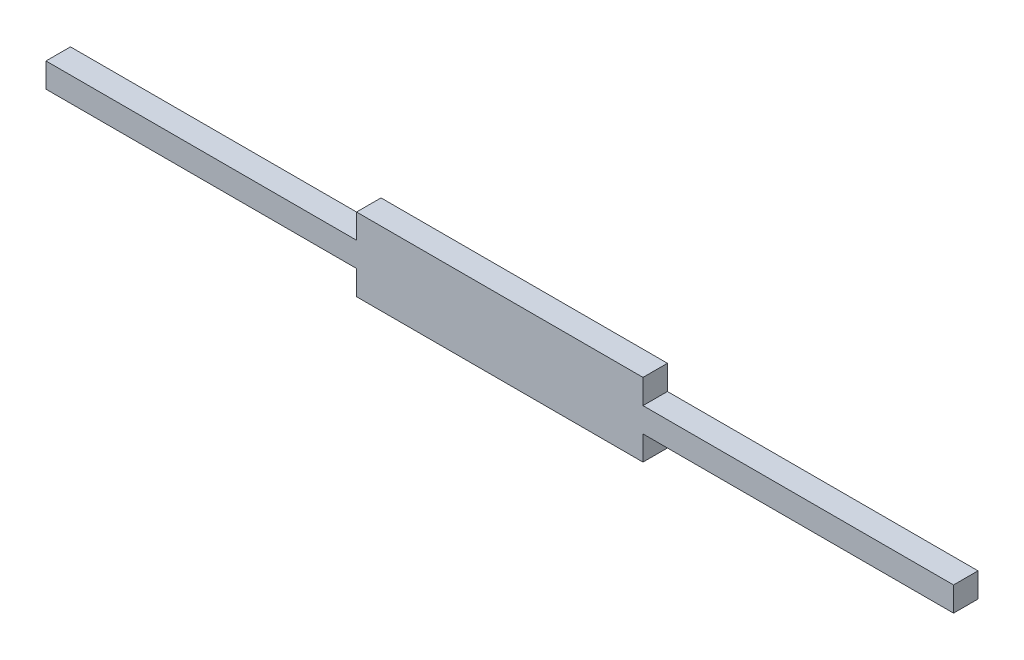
ISO-10303-21;
HEADER;
FILE_DESCRIPTION(('STEP AP214'),'2;1');
FILE_NAME('part.step','',(''),(''),'','','');
FILE_SCHEMA(('AUTOMOTIVE_DESIGN { 1 0 10303 214 1 1 1 1 }'));
ENDSEC;
DATA;
#1=APPLICATION_CONTEXT('core data for automotive mechanical design processes');
#2=APPLICATION_PROTOCOL_DEFINITION('international standard','automotive_design',2000,#1);
#3=PRODUCT_CONTEXT('',#1,'mechanical');
#4=PRODUCT('Part','Part','',(#3));
#5=PRODUCT_RELATED_PRODUCT_CATEGORY('part','',(#4));
#6=PRODUCT_DEFINITION_FORMATION('','',#4);
#7=PRODUCT_DEFINITION_CONTEXT('part definition',#1,'design');
#8=PRODUCT_DEFINITION('design','',#6,#7);
#9=PRODUCT_DEFINITION_SHAPE('','',#8);
#10=(LENGTH_UNIT() NAMED_UNIT(*) SI_UNIT(.MILLI.,.METRE.));
#11=(NAMED_UNIT(*) PLANE_ANGLE_UNIT() SI_UNIT($,.RADIAN.));
#12=(NAMED_UNIT(*) SI_UNIT($,.STERADIAN.) SOLID_ANGLE_UNIT());
#13=UNCERTAINTY_MEASURE_WITH_UNIT(LENGTH_MEASURE(1.E-05),#10,'distance_accuracy_value','');
#14=(GEOMETRIC_REPRESENTATION_CONTEXT(3) GLOBAL_UNCERTAINTY_ASSIGNED_CONTEXT((#13)) GLOBAL_UNIT_ASSIGNED_CONTEXT((#10,
#11,#12)) REPRESENTATION_CONTEXT('',''));
#15=CARTESIAN_POINT('',(0.,0.,0.));
#16=DIRECTION('',(0.,0.,1.));
#17=DIRECTION('',(1.,0.,0.));
#18=AXIS2_PLACEMENT_3D('',#15,#16,#17);
#19=CARTESIAN_POINT('',(-38.0590279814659,-1.524,1.524));
#20=DIRECTION('',(0.,-1.,0.));
#21=DIRECTION('',(0.,0.,-1.));
#22=AXIS2_PLACEMENT_3D('',#19,#20,#21);
#23=PLANE('',#22);
#24=DIRECTION('',(-1.,0.,0.));
#25=VECTOR('',#24,1.);
#26=CARTESIAN_POINT('',(-38.0590279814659,-1.524,0.));
#27=LINE('',#26,#25);
#28=CARTESIAN_POINT('',(-38.0590279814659,-1.524,0.));
#29=VERTEX_POINT('',#28);
#30=CARTESIAN_POINT('',(-57.4057448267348,-1.524,0.));
#31=VERTEX_POINT('',#30);
#32=EDGE_CURVE('E154',#29,#31,#27,.T.);
#33=ORIENTED_EDGE('',*,*,#32,.T.);
#34=DIRECTION('',(0.,0.,-1.));
#35=VECTOR('',#34,1.);
#36=CARTESIAN_POINT('',(-57.4057448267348,-1.524,1.524));
#37=LINE('',#36,#35);
#38=CARTESIAN_POINT('',(-57.4057448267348,-1.524,1.524));
#39=VERTEX_POINT('',#38);
#40=EDGE_CURVE('E11',#39,#31,#37,.T.);
#41=ORIENTED_EDGE('',*,*,#40,.F.);
#42=DIRECTION('',(-1.,0.,0.));
#43=VECTOR('',#42,1.);
#44=CARTESIAN_POINT('',(-38.0590279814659,-1.524,1.524));
#45=LINE('',#44,#43);
#46=CARTESIAN_POINT('',(-38.0590279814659,-1.524,1.524));
#47=VERTEX_POINT('',#46);
#48=EDGE_CURVE('E176',#47,#39,#45,.T.);
#49=ORIENTED_EDGE('',*,*,#48,.F.);
#50=DIRECTION('',(0.,0.,-1.));
#51=VECTOR('',#50,1.);
#52=CARTESIAN_POINT('',(-38.0590279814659,-1.524,1.524));
#53=LINE('',#52,#51);
#54=EDGE_CURVE('E150',#47,#29,#53,.T.);
#55=ORIENTED_EDGE('',*,*,#54,.T.);
#56=EDGE_LOOP('',(#33,#41,#49,#55));
#57=FACE_BOUND('',#56,.T.);
#58=ADVANCED_FACE('F34',(#57),#23,.F.);
#59=CARTESIAN_POINT('',(-57.4057448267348,-1.524,1.524));
#60=DIRECTION('',(1.,0.,0.));
#61=DIRECTION('',(0.,0.,-1.));
#62=AXIS2_PLACEMENT_3D('',#59,#60,#61);
#63=PLANE('',#62);
#64=DIRECTION('',(0.,-1.,0.));
#65=VECTOR('',#64,1.);
#66=CARTESIAN_POINT('',(-57.4057448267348,-1.524,0.));
#67=LINE('',#66,#65);
#68=CARTESIAN_POINT('',(-57.4057448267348,-3.048,0.));
#69=VERTEX_POINT('',#68);
#70=EDGE_CURVE('E157',#31,#69,#67,.T.);
#71=ORIENTED_EDGE('',*,*,#70,.T.);
#72=DIRECTION('',(0.,0.,-1.));
#73=VECTOR('',#72,1.);
#74=CARTESIAN_POINT('',(-57.4057448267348,-3.048,1.524));
#75=LINE('',#74,#73);
#76=CARTESIAN_POINT('',(-57.4057448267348,-3.048,1.524));
#77=VERTEX_POINT('',#76);
#78=EDGE_CURVE('E42',#77,#69,#75,.T.);
#79=ORIENTED_EDGE('',*,*,#78,.F.);
#80=DIRECTION('',(0.,-1.,0.));
#81=VECTOR('',#80,1.);
#82=CARTESIAN_POINT('',(-57.4057448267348,-1.524,1.524));
#83=LINE('',#82,#81);
#84=EDGE_CURVE('E105',#39,#77,#83,.T.);
#85=ORIENTED_EDGE('',*,*,#84,.F.);
#86=ORIENTED_EDGE('',*,*,#40,.T.);
#87=EDGE_LOOP('',(#71,#79,#85,#86));
#88=FACE_BOUND('',#87,.T.);
#89=ADVANCED_FACE('F254',(#88),#63,.F.);
#90=CARTESIAN_POINT('',(-38.0590279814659,-3.048,1.524));
#91=DIRECTION('',(0.,1.,0.));
#92=DIRECTION('',(0.,0.,1.));
#93=AXIS2_PLACEMENT_3D('',#90,#91,#92);
#94=PLANE('',#93);
#95=DIRECTION('',(1.,0.,0.));
#96=VECTOR('',#95,1.);
#97=CARTESIAN_POINT('',(-38.0590279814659,-3.048,0.));
#98=LINE('',#97,#96);
#99=CARTESIAN_POINT('',(-38.0590279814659,-3.048,0.));
#100=VERTEX_POINT('',#99);
#101=EDGE_CURVE('E159',#69,#100,#98,.T.);
#102=ORIENTED_EDGE('',*,*,#101,.T.);
#103=DIRECTION('',(0.,0.,-1.));
#104=VECTOR('',#103,1.);
#105=CARTESIAN_POINT('',(-38.0590279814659,-3.048,1.524));
#106=LINE('',#105,#104);
#107=CARTESIAN_POINT('',(-38.0590279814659,-3.048,1.524));
#108=VERTEX_POINT('',#107);
#109=EDGE_CURVE('E195',#108,#100,#106,.T.);
#110=ORIENTED_EDGE('',*,*,#109,.F.);
#111=DIRECTION('',(1.,0.,0.));
#112=VECTOR('',#111,1.);
#113=CARTESIAN_POINT('',(-38.0590279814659,-3.048,1.524));
#114=LINE('',#113,#112);
#115=EDGE_CURVE('E203',#77,#108,#114,.T.);
#116=ORIENTED_EDGE('',*,*,#115,.F.);
#117=ORIENTED_EDGE('',*,*,#78,.T.);
#118=EDGE_LOOP('',(#102,#110,#116,#117));
#119=FACE_BOUND('',#118,.T.);
#120=ADVANCED_FACE('F201',(#119),#94,.F.);
#121=CARTESIAN_POINT('',(-38.0590279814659,-3.048,1.524));
#122=DIRECTION('',(1.,0.,0.));
#123=DIRECTION('',(0.,0.,-1.));
#124=AXIS2_PLACEMENT_3D('',#121,#122,#123);
#125=PLANE('',#124);
#126=DIRECTION('',(0.,-1.,0.));
#127=VECTOR('',#126,1.);
#128=CARTESIAN_POINT('',(-38.0590279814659,-3.048,0.));
#129=LINE('',#128,#127);
#130=CARTESIAN_POINT('',(-38.0590279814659,-4.572,0.));
#131=VERTEX_POINT('',#130);
#132=EDGE_CURVE('E161',#100,#131,#129,.T.);
#133=ORIENTED_EDGE('',*,*,#132,.T.);
#134=DIRECTION('',(0.,0.,-1.));
#135=VECTOR('',#134,1.);
#136=CARTESIAN_POINT('',(-38.0590279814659,-4.572,1.524));
#137=LINE('',#136,#135);
#138=CARTESIAN_POINT('',(-38.0590279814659,-4.572,1.524));
#139=VERTEX_POINT('',#138);
#140=EDGE_CURVE('E192',#139,#131,#137,.T.);
#141=ORIENTED_EDGE('',*,*,#140,.F.);
#142=DIRECTION('',(0.,-1.,0.));
#143=VECTOR('',#142,1.);
#144=CARTESIAN_POINT('',(-38.0590279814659,-3.048,1.524));
#145=LINE('',#144,#143);
#146=EDGE_CURVE('E221',#108,#139,#145,.T.);
#147=ORIENTED_EDGE('',*,*,#146,.F.);
#148=ORIENTED_EDGE('',*,*,#109,.T.);
#149=EDGE_LOOP('',(#133,#141,#147,#148));
#150=FACE_BOUND('',#149,.T.);
#151=ADVANCED_FACE('F212',(#150),#125,.F.);
#152=CARTESIAN_POINT('',(-38.0590279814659,-4.572,1.524));
#153=DIRECTION('',(0.,1.,0.));
#154=DIRECTION('',(0.,0.,1.));
#155=AXIS2_PLACEMENT_3D('',#152,#153,#154);
#156=PLANE('',#155);
#157=DIRECTION('',(1.,0.,0.));
#158=VECTOR('',#157,1.);
#159=CARTESIAN_POINT('',(-38.0590279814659,-4.572,0.));
#160=LINE('',#159,#158);
#161=CARTESIAN_POINT('',(-20.2134687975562,-4.572,0.));
#162=VERTEX_POINT('',#161);
#163=EDGE_CURVE('E163',#131,#162,#160,.T.);
#164=ORIENTED_EDGE('',*,*,#163,.T.);
#165=DIRECTION('',(0.,0.,-1.));
#166=VECTOR('',#165,1.);
#167=CARTESIAN_POINT('',(-20.2134687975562,-4.572,1.524));
#168=LINE('',#167,#166);
#169=CARTESIAN_POINT('',(-20.2134687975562,-4.572,1.524));
#170=VERTEX_POINT('',#169);
#171=EDGE_CURVE('E189',#170,#162,#168,.T.);
#172=ORIENTED_EDGE('',*,*,#171,.F.);
#173=DIRECTION('',(1.,0.,0.));
#174=VECTOR('',#173,1.);
#175=CARTESIAN_POINT('',(-38.0590279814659,-4.572,1.524));
#176=LINE('',#175,#174);
#177=EDGE_CURVE('E218',#139,#170,#176,.T.);
#178=ORIENTED_EDGE('',*,*,#177,.F.);
#179=ORIENTED_EDGE('',*,*,#140,.T.);
#180=EDGE_LOOP('',(#164,#172,#178,#179));
#181=FACE_BOUND('',#180,.T.);
#182=ADVANCED_FACE('F216',(#181),#156,.F.);
#183=CARTESIAN_POINT('',(-20.2134687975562,-4.572,1.524));
#184=DIRECTION('',(-1.,0.,0.));
#185=DIRECTION('',(0.,0.,1.));
#186=AXIS2_PLACEMENT_3D('',#183,#184,#185);
#187=PLANE('',#186);
#188=DIRECTION('',(0.,1.,0.));
#189=VECTOR('',#188,1.);
#190=CARTESIAN_POINT('',(-20.2134687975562,-4.572,0.));
#191=LINE('',#190,#189);
#192=CARTESIAN_POINT('',(-20.2134687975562,-3.048,0.));
#193=VERTEX_POINT('',#192);
#194=EDGE_CURVE('E165',#162,#193,#191,.T.);
#195=ORIENTED_EDGE('',*,*,#194,.T.);
#196=DIRECTION('',(0.,0.,-1.));
#197=VECTOR('',#196,1.);
#198=CARTESIAN_POINT('',(-20.2134687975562,-3.048,1.524));
#199=LINE('',#198,#197);
#200=CARTESIAN_POINT('',(-20.2134687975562,-3.048,1.524));
#201=VERTEX_POINT('',#200);
#202=EDGE_CURVE('E186',#201,#193,#199,.T.);
#203=ORIENTED_EDGE('',*,*,#202,.F.);
#204=DIRECTION('',(0.,1.,0.));
#205=VECTOR('',#204,1.);
#206=CARTESIAN_POINT('',(-20.2134687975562,-4.572,1.524));
#207=LINE('',#206,#205);
#208=EDGE_CURVE('E220',#170,#201,#207,.T.);
#209=ORIENTED_EDGE('',*,*,#208,.F.);
#210=ORIENTED_EDGE('',*,*,#171,.T.);
#211=EDGE_LOOP('',(#195,#203,#209,#210));
#212=FACE_BOUND('',#211,.T.);
#213=ADVANCED_FACE('F267',(#212),#187,.F.);
#214=CARTESIAN_POINT('',(-20.2134687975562,-3.048,1.524));
#215=DIRECTION('',(0.,1.,0.));
#216=DIRECTION('',(0.,0.,1.));
#217=AXIS2_PLACEMENT_3D('',#214,#215,#216);
#218=PLANE('',#217);
#219=DIRECTION('',(1.,0.,0.));
#220=VECTOR('',#219,1.);
#221=CARTESIAN_POINT('',(-20.2134687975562,-3.048,0.));
#222=LINE('',#221,#220);
#223=CARTESIAN_POINT('',(-0.866751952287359,-3.048,0.));
#224=VERTEX_POINT('',#223);
#225=EDGE_CURVE('E167',#193,#224,#222,.T.);
#226=ORIENTED_EDGE('',*,*,#225,.T.);
#227=DIRECTION('',(0.,0.,-1.));
#228=VECTOR('',#227,1.);
#229=CARTESIAN_POINT('',(-0.866751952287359,-3.048,1.524));
#230=LINE('',#229,#228);
#231=CARTESIAN_POINT('',(-0.866751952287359,-3.048,1.524));
#232=VERTEX_POINT('',#231);
#233=EDGE_CURVE('E183',#232,#224,#230,.T.);
#234=ORIENTED_EDGE('',*,*,#233,.F.);
#235=DIRECTION('',(1.,0.,0.));
#236=VECTOR('',#235,1.);
#237=CARTESIAN_POINT('',(-20.2134687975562,-3.048,1.524));
#238=LINE('',#237,#236);
#239=EDGE_CURVE('E223',#201,#232,#238,.T.);
#240=ORIENTED_EDGE('',*,*,#239,.F.);
#241=ORIENTED_EDGE('',*,*,#202,.T.);
#242=EDGE_LOOP('',(#226,#234,#240,#241));
#243=FACE_BOUND('',#242,.T.);
#244=ADVANCED_FACE('F270',(#243),#218,.F.);
#245=CARTESIAN_POINT('',(-0.866751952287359,-1.524,1.524));
#246=DIRECTION('',(-1.,0.,0.));
#247=DIRECTION('',(0.,-1.,0.));
#248=AXIS2_PLACEMENT_3D('',#245,#246,#247);
#249=PLANE('',#248);
#250=DIRECTION('',(0.,1.,0.));
#251=VECTOR('',#250,1.);
#252=CARTESIAN_POINT('',(-0.866751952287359,-1.524,0.));
#253=LINE('',#252,#251);
#254=CARTESIAN_POINT('',(-0.866751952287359,-1.524,0.));
#255=VERTEX_POINT('',#254);
#256=EDGE_CURVE('E169',#224,#255,#253,.T.);
#257=ORIENTED_EDGE('',*,*,#256,.T.);
#258=DIRECTION('',(0.,0.,-1.));
#259=VECTOR('',#258,1.);
#260=CARTESIAN_POINT('',(-0.866751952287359,-1.524,1.524));
#261=LINE('',#260,#259);
#262=CARTESIAN_POINT('',(-0.866751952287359,-1.524,1.524));
#263=VERTEX_POINT('',#262);
#264=EDGE_CURVE('E180',#263,#255,#261,.T.);
#265=ORIENTED_EDGE('',*,*,#264,.F.);
#266=DIRECTION('',(0.,1.,0.));
#267=VECTOR('',#266,1.);
#268=CARTESIAN_POINT('',(-0.866751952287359,-1.524,1.524));
#269=LINE('',#268,#267);
#270=EDGE_CURVE('E229',#232,#263,#269,.T.);
#271=ORIENTED_EDGE('',*,*,#270,.F.);
#272=ORIENTED_EDGE('',*,*,#233,.T.);
#273=EDGE_LOOP('',(#257,#265,#271,#272));
#274=FACE_BOUND('',#273,.T.);
#275=ADVANCED_FACE('F235',(#274),#249,.F.);
#276=CARTESIAN_POINT('',(-20.2134687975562,-1.524,1.524));
#277=DIRECTION('',(0.,-1.,0.));
#278=DIRECTION('',(0.,0.,-1.));
#279=AXIS2_PLACEMENT_3D('',#276,#277,#278);
#280=PLANE('',#279);
#281=DIRECTION('',(-1.,0.,0.));
#282=VECTOR('',#281,1.);
#283=CARTESIAN_POINT('',(-20.2134687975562,-1.524,0.));
#284=LINE('',#283,#282);
#285=CARTESIAN_POINT('',(-20.2134687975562,-1.524,0.));
#286=VERTEX_POINT('',#285);
#287=EDGE_CURVE('E171',#255,#286,#284,.T.);
#288=ORIENTED_EDGE('',*,*,#287,.T.);
#289=DIRECTION('',(0.,0.,-1.));
#290=VECTOR('',#289,1.);
#291=CARTESIAN_POINT('',(-20.2134687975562,-1.524,1.524));
#292=LINE('',#291,#290);
#293=CARTESIAN_POINT('',(-20.2134687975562,-1.524,1.524));
#294=VERTEX_POINT('',#293);
#295=EDGE_CURVE('E145',#294,#286,#292,.T.);
#296=ORIENTED_EDGE('',*,*,#295,.F.);
#297=DIRECTION('',(-1.,0.,0.));
#298=VECTOR('',#297,1.);
#299=CARTESIAN_POINT('',(-20.2134687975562,-1.524,1.524));
#300=LINE('',#299,#298);
#301=EDGE_CURVE('E136',#263,#294,#300,.T.);
#302=ORIENTED_EDGE('',*,*,#301,.F.);
#303=ORIENTED_EDGE('',*,*,#264,.T.);
#304=EDGE_LOOP('',(#288,#296,#302,#303));
#305=FACE_BOUND('',#304,.T.);
#306=ADVANCED_FACE('F239',(#305),#280,.F.);
#307=CARTESIAN_POINT('',(-20.2134687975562,0.,1.524));
#308=DIRECTION('',(-1.,0.,0.));
#309=DIRECTION('',(0.,0.,1.));
#310=AXIS2_PLACEMENT_3D('',#307,#308,#309);
#311=PLANE('',#310);
#312=DIRECTION('',(0.,1.,0.));
#313=VECTOR('',#312,1.);
#314=CARTESIAN_POINT('',(-20.2134687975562,0.,0.));
#315=LINE('',#314,#313);
#316=CARTESIAN_POINT('',(-20.2134687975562,0.,0.));
#317=VERTEX_POINT('',#316);
#318=EDGE_CURVE('E144',#286,#317,#315,.T.);
#319=ORIENTED_EDGE('',*,*,#318,.T.);
#320=DIRECTION('',(0.,0.,-1.));
#321=VECTOR('',#320,1.);
#322=CARTESIAN_POINT('',(-20.2134687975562,0.,1.524));
#323=LINE('',#322,#321);
#324=CARTESIAN_POINT('',(-20.2134687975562,0.,1.524));
#325=VERTEX_POINT('',#324);
#326=EDGE_CURVE('E141',#325,#317,#323,.T.);
#327=ORIENTED_EDGE('',*,*,#326,.F.);
#328=DIRECTION('',(0.,1.,0.));
#329=VECTOR('',#328,1.);
#330=CARTESIAN_POINT('',(-20.2134687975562,0.,1.524));
#331=LINE('',#330,#329);
#332=EDGE_CURVE('E130',#294,#325,#331,.T.);
#333=ORIENTED_EDGE('',*,*,#332,.F.);
#334=ORIENTED_EDGE('',*,*,#295,.T.);
#335=EDGE_LOOP('',(#319,#327,#333,#334));
#336=FACE_BOUND('',#335,.T.);
#337=ADVANCED_FACE('F142',(#336),#311,.F.);
#338=CARTESIAN_POINT('',(-38.0590279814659,0.,1.524));
#339=DIRECTION('',(0.,-1.,0.));
#340=DIRECTION('',(0.,0.,-1.));
#341=AXIS2_PLACEMENT_3D('',#338,#339,#340);
#342=PLANE('',#341);
#343=DIRECTION('',(-1.,0.,0.));
#344=VECTOR('',#343,1.);
#345=CARTESIAN_POINT('',(-38.0590279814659,0.,0.));
#346=LINE('',#345,#344);
#347=CARTESIAN_POINT('',(-38.0590279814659,0.,0.));
#348=VERTEX_POINT('',#347);
#349=EDGE_CURVE('E91',#317,#348,#346,.T.);
#350=ORIENTED_EDGE('',*,*,#349,.T.);
#351=DIRECTION('',(0.,0.,-1.));
#352=VECTOR('',#351,1.);
#353=CARTESIAN_POINT('',(-38.0590279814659,0.,1.524));
#354=LINE('',#353,#352);
#355=CARTESIAN_POINT('',(-38.0590279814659,0.,1.524));
#356=VERTEX_POINT('',#355);
#357=EDGE_CURVE('E146',#356,#348,#354,.T.);
#358=ORIENTED_EDGE('',*,*,#357,.F.);
#359=DIRECTION('',(-1.,0.,0.));
#360=VECTOR('',#359,1.);
#361=CARTESIAN_POINT('',(-38.0590279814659,0.,1.524));
#362=LINE('',#361,#360);
#363=EDGE_CURVE('E134',#325,#356,#362,.T.);
#364=ORIENTED_EDGE('',*,*,#363,.F.);
#365=ORIENTED_EDGE('',*,*,#326,.T.);
#366=EDGE_LOOP('',(#350,#358,#364,#365));
#367=FACE_BOUND('',#366,.T.);
#368=ADVANCED_FACE('F148',(#367),#342,.F.);
#369=CARTESIAN_POINT('',(-38.0590279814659,-1.524,1.524));
#370=DIRECTION('',(1.,0.,0.));
#371=DIRECTION('',(0.,0.,-1.));
#372=AXIS2_PLACEMENT_3D('',#369,#370,#371);
#373=PLANE('',#372);
#374=DIRECTION('',(0.,-1.,0.));
#375=VECTOR('',#374,1.);
#376=CARTESIAN_POINT('',(-38.0590279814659,-1.524,0.));
#377=LINE('',#376,#375);
#378=EDGE_CURVE('E97',#348,#29,#377,.T.);
#379=ORIENTED_EDGE('',*,*,#378,.T.);
#380=ORIENTED_EDGE('',*,*,#54,.F.);
#381=DIRECTION('',(0.,-1.,0.));
#382=VECTOR('',#381,1.);
#383=CARTESIAN_POINT('',(-38.0590279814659,-1.524,1.524));
#384=LINE('',#383,#382);
#385=EDGE_CURVE('E50',#356,#47,#384,.T.);
#386=ORIENTED_EDGE('',*,*,#385,.F.);
#387=ORIENTED_EDGE('',*,*,#357,.T.);
#388=EDGE_LOOP('',(#379,#380,#386,#387));
#389=FACE_BOUND('',#388,.T.);
#390=ADVANCED_FACE('F243',(#389),#373,.F.);
#391=CARTESIAN_POINT('',(0.,0.,1.524));
#392=DIRECTION('',(0.,0.,1.));
#393=DIRECTION('',(1.,0.,0.));
#394=AXIS2_PLACEMENT_3D('',#391,#392,#393);
#395=PLANE('',#394);
#396=ORIENTED_EDGE('',*,*,#48,.T.);
#397=ORIENTED_EDGE('',*,*,#84,.T.);
#398=ORIENTED_EDGE('',*,*,#115,.T.);
#399=ORIENTED_EDGE('',*,*,#146,.T.);
#400=ORIENTED_EDGE('',*,*,#177,.T.);
#401=ORIENTED_EDGE('',*,*,#208,.T.);
#402=ORIENTED_EDGE('',*,*,#239,.T.);
#403=ORIENTED_EDGE('',*,*,#270,.T.);
#404=ORIENTED_EDGE('',*,*,#301,.T.);
#405=ORIENTED_EDGE('',*,*,#332,.T.);
#406=ORIENTED_EDGE('',*,*,#363,.T.);
#407=ORIENTED_EDGE('',*,*,#385,.T.);
#408=EDGE_LOOP('',(#396,#397,#398,#399,#400,#401,#402,#403,#404,#405,#406,#407));
#409=FACE_BOUND('',#408,.T.);
#410=ADVANCED_FACE('F132',(#409),#395,.T.);
#411=CARTESIAN_POINT('',(0.,0.,0.));
#412=DIRECTION('',(0.,0.,1.));
#413=DIRECTION('',(1.,0.,0.));
#414=AXIS2_PLACEMENT_3D('',#411,#412,#413);
#415=PLANE('',#414);
#416=ORIENTED_EDGE('',*,*,#32,.F.);
#417=ORIENTED_EDGE('',*,*,#378,.F.);
#418=ORIENTED_EDGE('',*,*,#349,.F.);
#419=ORIENTED_EDGE('',*,*,#318,.F.);
#420=ORIENTED_EDGE('',*,*,#287,.F.);
#421=ORIENTED_EDGE('',*,*,#256,.F.);
#422=ORIENTED_EDGE('',*,*,#225,.F.);
#423=ORIENTED_EDGE('',*,*,#194,.F.);
#424=ORIENTED_EDGE('',*,*,#163,.F.);
#425=ORIENTED_EDGE('',*,*,#132,.F.);
#426=ORIENTED_EDGE('',*,*,#101,.F.);
#427=ORIENTED_EDGE('',*,*,#70,.F.);
#428=EDGE_LOOP('',(#416,#417,#418,#419,#420,#421,#422,#423,#424,#425,#426,#427));
#429=FACE_BOUND('',#428,.T.);
#430=ADVANCED_FACE('F207',(#429),#415,.F.);
#431=CLOSED_SHELL('',(#58,#89,#120,#151,#182,#213,#244,#275,#306,#337,#368,#390,#410,#430));
#432=MANIFOLD_SOLID_BREP('B2',#431);
#433=ADVANCED_BREP_SHAPE_REPRESENTATION('',(#18,#432),#14);
#434=SHAPE_DEFINITION_REPRESENTATION(#9,#433);
ENDSEC;
END-ISO-10303-21;
